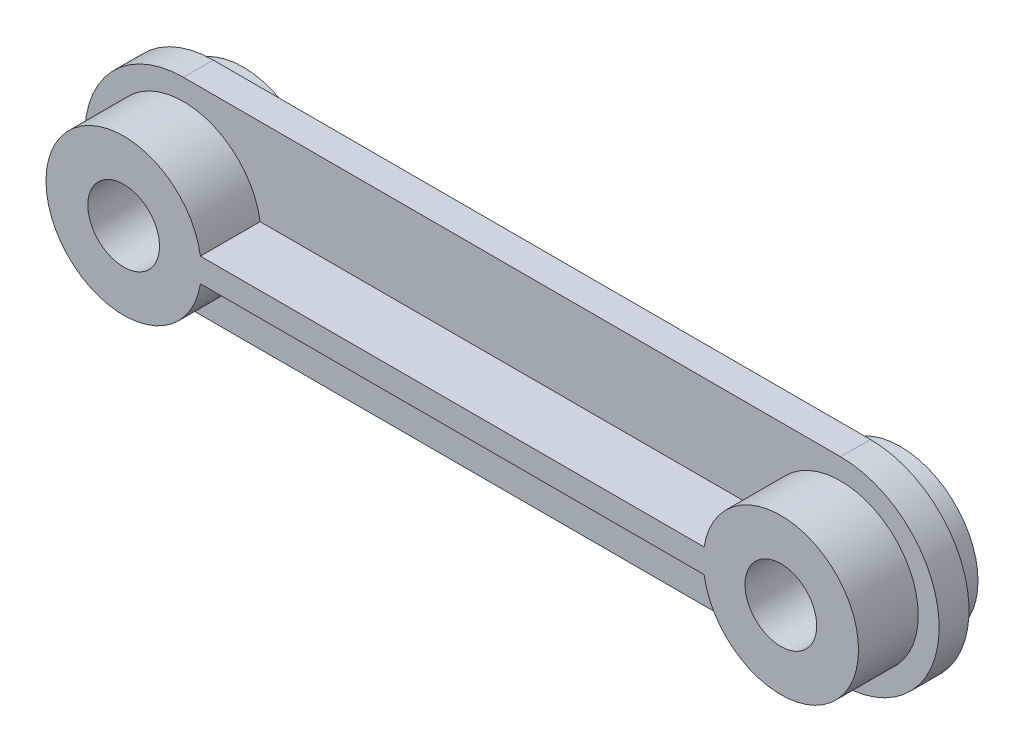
ISO-10303-21;
HEADER;
FILE_DESCRIPTION(('STEP AP214'),'2;1');
FILE_NAME('part.step','',(''),(''),'','','');
FILE_SCHEMA(('AUTOMOTIVE_DESIGN { 1 0 10303 214 1 1 1 1 }'));
ENDSEC;
DATA;
#1=APPLICATION_CONTEXT('core data for automotive mechanical design processes');
#2=APPLICATION_PROTOCOL_DEFINITION('international standard','automotive_design',2000,#1);
#3=PRODUCT_CONTEXT('',#1,'mechanical');
#4=PRODUCT('Part','Part','',(#3));
#5=PRODUCT_RELATED_PRODUCT_CATEGORY('part','',(#4));
#6=PRODUCT_DEFINITION_FORMATION('','',#4);
#7=PRODUCT_DEFINITION_CONTEXT('part definition',#1,'design');
#8=PRODUCT_DEFINITION('design','',#6,#7);
#9=PRODUCT_DEFINITION_SHAPE('','',#8);
#10=(LENGTH_UNIT() NAMED_UNIT(*) SI_UNIT(.MILLI.,.METRE.));
#11=(NAMED_UNIT(*) PLANE_ANGLE_UNIT() SI_UNIT($,.RADIAN.));
#12=(NAMED_UNIT(*) SI_UNIT($,.STERADIAN.) SOLID_ANGLE_UNIT());
#13=UNCERTAINTY_MEASURE_WITH_UNIT(LENGTH_MEASURE(1.E-05),#10,'distance_accuracy_value','');
#14=(GEOMETRIC_REPRESENTATION_CONTEXT(3) GLOBAL_UNCERTAINTY_ASSIGNED_CONTEXT((#13)) GLOBAL_UNIT_ASSIGNED_CONTEXT((#10,
#11,#12)) REPRESENTATION_CONTEXT('',''));
#15=CARTESIAN_POINT('',(0.,0.,0.));
#16=DIRECTION('',(0.,0.,1.));
#17=DIRECTION('',(1.,0.,0.));
#18=AXIS2_PLACEMENT_3D('',#15,#16,#17);
#19=CARTESIAN_POINT('',(-110.,0.,0.));
#20=DIRECTION('',(0.,0.,1.));
#21=DIRECTION('',(1.,0.,0.));
#22=AXIS2_PLACEMENT_3D('',#19,#20,#21);
#23=PLANE('',#22);
#24=CARTESIAN_POINT('',(110.,0.,0.));
#25=DIRECTION('',(0.,0.,1.));
#26=DIRECTION('',(1.,0.,0.));
#27=AXIS2_PLACEMENT_3D('',#24,#25,#26);
#28=CIRCLE('',#27,26.);
#29=CARTESIAN_POINT('',(136.,0.,0.));
#30=VERTEX_POINT('',#29);
#31=EDGE_CURVE('E47',#30,#30,#28,.F.);
#32=ORIENTED_EDGE('',*,*,#31,.F.);
#33=EDGE_LOOP('',(#32));
#34=FACE_BOUND('',#33,.T.);
#35=CARTESIAN_POINT('',(-110.,0.,0.));
#36=DIRECTION('',(0.,0.,1.));
#37=DIRECTION('',(1.,0.,0.));
#38=AXIS2_PLACEMENT_3D('',#35,#36,#37);
#39=CIRCLE('',#38,33.);
#40=CARTESIAN_POINT('',(-110.,33.,0.));
#41=VERTEX_POINT('',#40);
#42=CARTESIAN_POINT('',(-110.,-33.,0.));
#43=VERTEX_POINT('',#42);
#44=EDGE_CURVE('E116',#41,#43,#39,.T.);
#45=ORIENTED_EDGE('',*,*,#44,.F.);
#46=DIRECTION('',(-1.,0.,0.));
#47=VECTOR('',#46,1.);
#48=CARTESIAN_POINT('',(-110.,33.,0.));
#49=LINE('',#48,#47);
#50=CARTESIAN_POINT('',(110.,33.,0.));
#51=VERTEX_POINT('',#50);
#52=EDGE_CURVE('E154',#51,#41,#49,.T.);
#53=ORIENTED_EDGE('',*,*,#52,.F.);
#54=CARTESIAN_POINT('',(110.,0.,0.));
#55=DIRECTION('',(0.,0.,1.));
#56=DIRECTION('',(1.,0.,0.));
#57=AXIS2_PLACEMENT_3D('',#54,#55,#56);
#58=CIRCLE('',#57,33.);
#59=CARTESIAN_POINT('',(110.,-33.,0.));
#60=VERTEX_POINT('',#59);
#61=EDGE_CURVE('E152',#60,#51,#58,.T.);
#62=ORIENTED_EDGE('',*,*,#61,.F.);
#63=DIRECTION('',(1.,0.,0.));
#64=VECTOR('',#63,1.);
#65=CARTESIAN_POINT('',(-110.,-33.,0.));
#66=LINE('',#65,#64);
#67=EDGE_CURVE('E150',#43,#60,#66,.T.);
#68=ORIENTED_EDGE('',*,*,#67,.F.);
#69=EDGE_LOOP('',(#45,#53,#62,#68));
#70=FACE_BOUND('',#69,.T.);
#71=CARTESIAN_POINT('',(-110.,0.,0.));
#72=DIRECTION('',(0.,0.,1.));
#73=DIRECTION('',(1.,0.,0.));
#74=AXIS2_PLACEMENT_3D('',#71,#72,#73);
#75=CIRCLE('',#74,26.);
#76=CARTESIAN_POINT('',(-84.,0.,0.));
#77=VERTEX_POINT('',#76);
#78=EDGE_CURVE('E11',#77,#77,#75,.F.);
#79=ORIENTED_EDGE('',*,*,#78,.F.);
#80=EDGE_LOOP('',(#79));
#81=FACE_BOUND('',#80,.T.);
#82=ADVANCED_FACE('F39',(#34,#70,#81),#23,.F.);
#83=CARTESIAN_POINT('',(-110.,0.,10.));
#84=DIRECTION('',(0.,0.,1.));
#85=DIRECTION('',(1.,0.,0.));
#86=AXIS2_PLACEMENT_3D('',#83,#84,#85);
#87=PLANE('',#86);
#88=CARTESIAN_POINT('',(-110.,0.,10.));
#89=DIRECTION('',(0.,0.,1.));
#90=DIRECTION('',(1.,0.,0.));
#91=AXIS2_PLACEMENT_3D('',#88,#89,#90);
#92=CIRCLE('',#91,33.);
#93=CARTESIAN_POINT('',(-110.,33.,10.));
#94=VERTEX_POINT('',#93);
#95=CARTESIAN_POINT('',(-110.,-33.,10.));
#96=VERTEX_POINT('',#95);
#97=EDGE_CURVE('E156',#94,#96,#92,.T.);
#98=ORIENTED_EDGE('',*,*,#97,.T.);
#99=DIRECTION('',(1.,0.,0.));
#100=VECTOR('',#99,1.);
#101=CARTESIAN_POINT('',(-110.,-33.,10.));
#102=LINE('',#101,#100);
#103=CARTESIAN_POINT('',(110.,-33.,10.));
#104=VERTEX_POINT('',#103);
#105=EDGE_CURVE('E158',#96,#104,#102,.T.);
#106=ORIENTED_EDGE('',*,*,#105,.T.);
#107=CARTESIAN_POINT('',(110.,0.,10.));
#108=DIRECTION('',(0.,0.,1.));
#109=DIRECTION('',(1.,0.,0.));
#110=AXIS2_PLACEMENT_3D('',#107,#108,#109);
#111=CIRCLE('',#110,33.);
#112=CARTESIAN_POINT('',(110.,33.,10.));
#113=VERTEX_POINT('',#112);
#114=EDGE_CURVE('E160',#104,#113,#111,.T.);
#115=ORIENTED_EDGE('',*,*,#114,.T.);
#116=DIRECTION('',(-1.,0.,0.));
#117=VECTOR('',#116,1.);
#118=CARTESIAN_POINT('',(-110.,33.,10.));
#119=LINE('',#118,#117);
#120=EDGE_CURVE('E62',#113,#94,#119,.T.);
#121=ORIENTED_EDGE('',*,*,#120,.T.);
#122=EDGE_LOOP('',(#98,#106,#115,#121));
#123=FACE_BOUND('',#122,.T.);
#124=DIRECTION('',(1.,0.,0.));
#125=VECTOR('',#124,1.);
#126=CARTESIAN_POINT('',(-84.3095348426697,-4.,10.));
#127=LINE('',#126,#125);
#128=CARTESIAN_POINT('',(-84.3095348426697,-4.,10.));
#129=VERTEX_POINT('',#128);
#130=CARTESIAN_POINT('',(84.3095348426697,-4.,10.));
#131=VERTEX_POINT('',#130);
#132=EDGE_CURVE('E110',#129,#131,#127,.T.);
#133=ORIENTED_EDGE('',*,*,#132,.F.);
#134=CARTESIAN_POINT('',(-110.,0.,10.));
#135=DIRECTION('',(0.,0.,1.));
#136=DIRECTION('',(1.,0.,0.));
#137=AXIS2_PLACEMENT_3D('',#134,#135,#136);
#138=CIRCLE('',#137,26.);
#139=CARTESIAN_POINT('',(-84.3095348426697,4.,10.));
#140=VERTEX_POINT('',#139);
#141=EDGE_CURVE('E121',#140,#129,#138,.T.);
#142=ORIENTED_EDGE('',*,*,#141,.F.);
#143=DIRECTION('',(-1.,0.,0.));
#144=VECTOR('',#143,1.);
#145=CARTESIAN_POINT('',(-84.3095348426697,4.,10.));
#146=LINE('',#145,#144);
#147=CARTESIAN_POINT('',(84.3095348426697,4.,10.));
#148=VERTEX_POINT('',#147);
#149=EDGE_CURVE('E133',#148,#140,#146,.T.);
#150=ORIENTED_EDGE('',*,*,#149,.F.);
#151=CARTESIAN_POINT('',(110.,0.,10.));
#152=DIRECTION('',(0.,0.,1.));
#153=DIRECTION('',(1.,0.,0.));
#154=AXIS2_PLACEMENT_3D('',#151,#152,#153);
#155=CIRCLE('',#154,26.);
#156=EDGE_CURVE('E131',#131,#148,#155,.T.);
#157=ORIENTED_EDGE('',*,*,#156,.F.);
#158=EDGE_LOOP('',(#133,#142,#150,#157));
#159=FACE_BOUND('',#158,.T.);
#160=ADVANCED_FACE('F130',(#123,#159),#87,.T.);
#161=CARTESIAN_POINT('',(-110.,0.,10.));
#162=DIRECTION('',(0.,0.,-1.));
#163=DIRECTION('',(-1.,0.,0.));
#164=AXIS2_PLACEMENT_3D('',#161,#162,#163);
#165=CYLINDRICAL_SURFACE('',#164,33.);
#166=ORIENTED_EDGE('',*,*,#44,.T.);
#167=DIRECTION('',(0.,0.,-1.));
#168=VECTOR('',#167,1.);
#169=CARTESIAN_POINT('',(-110.,-33.,10.));
#170=LINE('',#169,#168);
#171=EDGE_CURVE('E172',#96,#43,#170,.T.);
#172=ORIENTED_EDGE('',*,*,#171,.F.);
#173=ORIENTED_EDGE('',*,*,#97,.F.);
#174=DIRECTION('',(0.,0.,-1.));
#175=VECTOR('',#174,1.);
#176=CARTESIAN_POINT('',(-110.,33.,10.));
#177=LINE('',#176,#175);
#178=EDGE_CURVE('E163',#94,#41,#177,.T.);
#179=ORIENTED_EDGE('',*,*,#178,.T.);
#180=EDGE_LOOP('',(#166,#172,#173,#179));
#181=FACE_BOUND('',#180,.T.);
#182=ADVANCED_FACE('F41',(#181),#165,.T.);
#183=CARTESIAN_POINT('',(-110.,-33.,10.));
#184=DIRECTION('',(0.,1.,0.));
#185=DIRECTION('',(-1.,0.,0.));
#186=AXIS2_PLACEMENT_3D('',#183,#184,#185);
#187=PLANE('',#186);
#188=ORIENTED_EDGE('',*,*,#67,.T.);
#189=DIRECTION('',(0.,0.,-1.));
#190=VECTOR('',#189,1.);
#191=CARTESIAN_POINT('',(110.,-33.,10.));
#192=LINE('',#191,#190);
#193=EDGE_CURVE('E169',#104,#60,#192,.T.);
#194=ORIENTED_EDGE('',*,*,#193,.F.);
#195=ORIENTED_EDGE('',*,*,#105,.F.);
#196=ORIENTED_EDGE('',*,*,#171,.T.);
#197=EDGE_LOOP('',(#188,#194,#195,#196));
#198=FACE_BOUND('',#197,.T.);
#199=ADVANCED_FACE('F231',(#198),#187,.F.);
#200=CARTESIAN_POINT('',(110.,0.,10.));
#201=DIRECTION('',(0.,0.,-1.));
#202=DIRECTION('',(-1.,0.,0.));
#203=AXIS2_PLACEMENT_3D('',#200,#201,#202);
#204=CYLINDRICAL_SURFACE('',#203,33.);
#205=ORIENTED_EDGE('',*,*,#61,.T.);
#206=DIRECTION('',(0.,0.,-1.));
#207=VECTOR('',#206,1.);
#208=CARTESIAN_POINT('',(110.,33.,10.));
#209=LINE('',#208,#207);
#210=EDGE_CURVE('E166',#113,#51,#209,.T.);
#211=ORIENTED_EDGE('',*,*,#210,.F.);
#212=ORIENTED_EDGE('',*,*,#114,.F.);
#213=ORIENTED_EDGE('',*,*,#193,.T.);
#214=EDGE_LOOP('',(#205,#211,#212,#213));
#215=FACE_BOUND('',#214,.T.);
#216=ADVANCED_FACE('F228',(#215),#204,.T.);
#217=CARTESIAN_POINT('',(-110.,33.,10.));
#218=DIRECTION('',(0.,-1.,0.));
#219=DIRECTION('',(1.,0.,0.));
#220=AXIS2_PLACEMENT_3D('',#217,#218,#219);
#221=PLANE('',#220);
#222=ORIENTED_EDGE('',*,*,#52,.T.);
#223=ORIENTED_EDGE('',*,*,#178,.F.);
#224=ORIENTED_EDGE('',*,*,#120,.F.);
#225=ORIENTED_EDGE('',*,*,#210,.T.);
#226=EDGE_LOOP('',(#222,#223,#224,#225));
#227=FACE_BOUND('',#226,.T.);
#228=ADVANCED_FACE('F222',(#227),#221,.F.);
#229=CARTESIAN_POINT('',(-110.,0.,30.));
#230=DIRECTION('',(0.,0.,-1.));
#231=DIRECTION('',(-1.,0.,0.));
#232=AXIS2_PLACEMENT_3D('',#229,#230,#231);
#233=CYLINDRICAL_SURFACE('',#232,26.);
#234=ORIENTED_EDGE('',*,*,#141,.T.);
#235=DIRECTION('',(0.,0.,-1.));
#236=VECTOR('',#235,1.);
#237=CARTESIAN_POINT('',(-84.3095348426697,-4.,30.));
#238=LINE('',#237,#236);
#239=CARTESIAN_POINT('',(-84.3095348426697,-4.,30.));
#240=VERTEX_POINT('',#239);
#241=EDGE_CURVE('E105',#240,#129,#238,.T.);
#242=ORIENTED_EDGE('',*,*,#241,.F.);
#243=CARTESIAN_POINT('',(-110.,0.,30.));
#244=DIRECTION('',(0.,0.,1.));
#245=DIRECTION('',(1.,0.,0.));
#246=AXIS2_PLACEMENT_3D('',#243,#244,#245);
#247=CIRCLE('',#246,26.);
#248=CARTESIAN_POINT('',(-84.3095348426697,4.,30.));
#249=VERTEX_POINT('',#248);
#250=EDGE_CURVE('E138',#249,#240,#247,.T.);
#251=ORIENTED_EDGE('',*,*,#250,.F.);
#252=DIRECTION('',(0.,0.,-1.));
#253=VECTOR('',#252,1.);
#254=CARTESIAN_POINT('',(-84.3095348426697,4.,30.));
#255=LINE('',#254,#253);
#256=EDGE_CURVE('E124',#249,#140,#255,.T.);
#257=ORIENTED_EDGE('',*,*,#256,.T.);
#258=EDGE_LOOP('',(#234,#242,#251,#257));
#259=FACE_BOUND('',#258,.T.);
#260=ADVANCED_FACE('F122',(#259),#233,.T.);
#261=CARTESIAN_POINT('',(-84.3095348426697,-4.,30.));
#262=DIRECTION('',(0.,1.,0.));
#263=DIRECTION('',(0.,0.,1.));
#264=AXIS2_PLACEMENT_3D('',#261,#262,#263);
#265=PLANE('',#264);
#266=ORIENTED_EDGE('',*,*,#132,.T.);
#267=DIRECTION('',(0.,0.,-1.));
#268=VECTOR('',#267,1.);
#269=CARTESIAN_POINT('',(84.3095348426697,-4.,30.));
#270=LINE('',#269,#268);
#271=CARTESIAN_POINT('',(84.3095348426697,-4.,30.));
#272=VERTEX_POINT('',#271);
#273=EDGE_CURVE('E117',#272,#131,#270,.T.);
#274=ORIENTED_EDGE('',*,*,#273,.F.);
#275=DIRECTION('',(1.,0.,0.));
#276=VECTOR('',#275,1.);
#277=CARTESIAN_POINT('',(-84.3095348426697,-4.,30.));
#278=LINE('',#277,#276);
#279=EDGE_CURVE('E112',#240,#272,#278,.T.);
#280=ORIENTED_EDGE('',*,*,#279,.F.);
#281=ORIENTED_EDGE('',*,*,#241,.T.);
#282=EDGE_LOOP('',(#266,#274,#280,#281));
#283=FACE_BOUND('',#282,.T.);
#284=ADVANCED_FACE('F107',(#283),#265,.F.);
#285=CARTESIAN_POINT('',(110.,0.,30.));
#286=DIRECTION('',(0.,0.,-1.));
#287=DIRECTION('',(-1.,0.,0.));
#288=AXIS2_PLACEMENT_3D('',#285,#286,#287);
#289=CYLINDRICAL_SURFACE('',#288,26.);
#290=ORIENTED_EDGE('',*,*,#156,.T.);
#291=DIRECTION('',(0.,0.,-1.));
#292=VECTOR('',#291,1.);
#293=CARTESIAN_POINT('',(84.3095348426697,4.,30.));
#294=LINE('',#293,#292);
#295=CARTESIAN_POINT('',(84.3095348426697,4.,30.));
#296=VERTEX_POINT('',#295);
#297=EDGE_CURVE('E54',#296,#148,#294,.T.);
#298=ORIENTED_EDGE('',*,*,#297,.F.);
#299=CARTESIAN_POINT('',(110.,0.,30.));
#300=DIRECTION('',(0.,0.,1.));
#301=DIRECTION('',(1.,0.,0.));
#302=AXIS2_PLACEMENT_3D('',#299,#300,#301);
#303=CIRCLE('',#302,26.);
#304=EDGE_CURVE('E141',#272,#296,#303,.T.);
#305=ORIENTED_EDGE('',*,*,#304,.F.);
#306=ORIENTED_EDGE('',*,*,#273,.T.);
#307=EDGE_LOOP('',(#290,#298,#305,#306));
#308=FACE_BOUND('',#307,.T.);
#309=ADVANCED_FACE('F215',(#308),#289,.T.);
#310=CARTESIAN_POINT('',(-84.3095348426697,4.,30.));
#311=DIRECTION('',(0.,-1.,0.));
#312=DIRECTION('',(0.,0.,-1.));
#313=AXIS2_PLACEMENT_3D('',#310,#311,#312);
#314=PLANE('',#313);
#315=ORIENTED_EDGE('',*,*,#149,.T.);
#316=ORIENTED_EDGE('',*,*,#256,.F.);
#317=DIRECTION('',(-1.,0.,0.));
#318=VECTOR('',#317,1.);
#319=CARTESIAN_POINT('',(-84.3095348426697,4.,30.));
#320=LINE('',#319,#318);
#321=EDGE_CURVE('E143',#296,#249,#320,.T.);
#322=ORIENTED_EDGE('',*,*,#321,.F.);
#323=ORIENTED_EDGE('',*,*,#297,.T.);
#324=EDGE_LOOP('',(#315,#316,#322,#323));
#325=FACE_BOUND('',#324,.T.);
#326=ADVANCED_FACE('F211',(#325),#314,.F.);
#327=CARTESIAN_POINT('',(-110.,0.,30.));
#328=DIRECTION('',(0.,0.,1.));
#329=DIRECTION('',(1.,0.,0.));
#330=AXIS2_PLACEMENT_3D('',#327,#328,#329);
#331=PLANE('',#330);
#332=CARTESIAN_POINT('',(-110.,0.,30.));
#333=DIRECTION('',(0.,0.,-1.));
#334=DIRECTION('',(-1.,0.,0.));
#335=AXIS2_PLACEMENT_3D('',#332,#333,#334);
#336=CIRCLE('',#335,12.);
#337=CARTESIAN_POINT('',(-122.,0.,30.));
#338=VERTEX_POINT('',#337);
#339=EDGE_CURVE('E318',#338,#338,#336,.T.);
#340=ORIENTED_EDGE('',*,*,#339,.T.);
#341=EDGE_LOOP('',(#340));
#342=FACE_BOUND('',#341,.T.);
#343=CARTESIAN_POINT('',(110.,0.,30.));
#344=DIRECTION('',(0.,0.,-1.));
#345=DIRECTION('',(-1.,0.,0.));
#346=AXIS2_PLACEMENT_3D('',#343,#344,#345);
#347=CIRCLE('',#346,12.);
#348=CARTESIAN_POINT('',(98.,0.,30.));
#349=VERTEX_POINT('',#348);
#350=EDGE_CURVE('E328',#349,#349,#347,.T.);
#351=ORIENTED_EDGE('',*,*,#350,.T.);
#352=EDGE_LOOP('',(#351));
#353=FACE_BOUND('',#352,.T.);
#354=ORIENTED_EDGE('',*,*,#250,.T.);
#355=ORIENTED_EDGE('',*,*,#279,.T.);
#356=ORIENTED_EDGE('',*,*,#304,.T.);
#357=ORIENTED_EDGE('',*,*,#321,.T.);
#358=EDGE_LOOP('',(#354,#355,#356,#357));
#359=FACE_BOUND('',#358,.T.);
#360=ADVANCED_FACE('F208',(#342,#353,#359),#331,.T.);
#361=CARTESIAN_POINT('',(110.,0.,-10.));
#362=DIRECTION('',(0.,0.,1.));
#363=DIRECTION('',(1.,0.,0.));
#364=AXIS2_PLACEMENT_3D('',#361,#362,#363);
#365=CYLINDRICAL_SURFACE('',#364,26.);
#366=CARTESIAN_POINT('',(110.,0.,-10.));
#367=DIRECTION('',(0.,0.,-1.));
#368=DIRECTION('',(-1.,0.,0.));
#369=AXIS2_PLACEMENT_3D('',#366,#367,#368);
#370=CIRCLE('',#369,26.);
#371=CARTESIAN_POINT('',(84.,0.,-10.));
#372=VERTEX_POINT('',#371);
#373=EDGE_CURVE('E127',#372,#372,#370,.T.);
#374=ORIENTED_EDGE('',*,*,#373,.F.);
#375=EDGE_LOOP('',(#374));
#376=FACE_BOUND('',#375,.T.);
#377=ORIENTED_EDGE('',*,*,#31,.T.);
#378=EDGE_LOOP('',(#377));
#379=FACE_BOUND('',#378,.T.);
#380=ADVANCED_FACE('F177',(#376,#379),#365,.T.);
#381=CARTESIAN_POINT('',(110.,0.,-10.));
#382=DIRECTION('',(0.,0.,-1.));
#383=DIRECTION('',(-1.,0.,0.));
#384=AXIS2_PLACEMENT_3D('',#381,#382,#383);
#385=PLANE('',#384);
#386=CARTESIAN_POINT('',(110.,0.,-10.));
#387=DIRECTION('',(0.,0.,-1.));
#388=DIRECTION('',(-1.,0.,0.));
#389=AXIS2_PLACEMENT_3D('',#386,#387,#388);
#390=CIRCLE('',#389,12.);
#391=CARTESIAN_POINT('',(98.,0.,-10.));
#392=VERTEX_POINT('',#391);
#393=EDGE_CURVE('E323',#392,#392,#390,.T.);
#394=ORIENTED_EDGE('',*,*,#393,.F.);
#395=EDGE_LOOP('',(#394));
#396=FACE_BOUND('',#395,.T.);
#397=ORIENTED_EDGE('',*,*,#373,.T.);
#398=EDGE_LOOP('',(#397));
#399=FACE_BOUND('',#398,.T.);
#400=ADVANCED_FACE('F190',(#396,#399),#385,.T.);
#401=CARTESIAN_POINT('',(-110.,0.,-10.));
#402=DIRECTION('',(0.,0.,1.));
#403=DIRECTION('',(1.,0.,0.));
#404=AXIS2_PLACEMENT_3D('',#401,#402,#403);
#405=CYLINDRICAL_SURFACE('',#404,26.);
#406=CARTESIAN_POINT('',(-110.,0.,-10.));
#407=DIRECTION('',(0.,0.,-1.));
#408=DIRECTION('',(-1.,0.,0.));
#409=AXIS2_PLACEMENT_3D('',#406,#407,#408);
#410=CIRCLE('',#409,26.);
#411=CARTESIAN_POINT('',(-136.,0.,-10.));
#412=VERTEX_POINT('',#411);
#413=EDGE_CURVE('E331',#412,#412,#410,.T.);
#414=ORIENTED_EDGE('',*,*,#413,.F.);
#415=EDGE_LOOP('',(#414));
#416=FACE_BOUND('',#415,.T.);
#417=ORIENTED_EDGE('',*,*,#78,.T.);
#418=EDGE_LOOP('',(#417));
#419=FACE_BOUND('',#418,.T.);
#420=ADVANCED_FACE('F187',(#416,#419),#405,.T.);
#421=CARTESIAN_POINT('',(-110.,0.,-10.));
#422=DIRECTION('',(0.,0.,-1.));
#423=DIRECTION('',(-1.,0.,0.));
#424=AXIS2_PLACEMENT_3D('',#421,#422,#423);
#425=PLANE('',#424);
#426=CARTESIAN_POINT('',(-110.,0.,-10.));
#427=DIRECTION('',(0.,0.,-1.));
#428=DIRECTION('',(-1.,0.,0.));
#429=AXIS2_PLACEMENT_3D('',#426,#427,#428);
#430=CIRCLE('',#429,12.);
#431=CARTESIAN_POINT('',(-122.,0.,-10.));
#432=VERTEX_POINT('',#431);
#433=EDGE_CURVE('E321',#432,#432,#430,.T.);
#434=ORIENTED_EDGE('',*,*,#433,.F.);
#435=EDGE_LOOP('',(#434));
#436=FACE_BOUND('',#435,.T.);
#437=ORIENTED_EDGE('',*,*,#413,.T.);
#438=EDGE_LOOP('',(#437));
#439=FACE_BOUND('',#438,.T.);
#440=ADVANCED_FACE('F189',(#436,#439),#425,.T.);
#441=CARTESIAN_POINT('',(110.,0.,30.));
#442=DIRECTION('',(0.,0.,-1.));
#443=DIRECTION('',(-1.,0.,0.));
#444=AXIS2_PLACEMENT_3D('',#441,#442,#443);
#445=CYLINDRICAL_SURFACE('',#444,12.);
#446=ORIENTED_EDGE('',*,*,#350,.F.);
#447=EDGE_LOOP('',(#446));
#448=FACE_BOUND('',#447,.T.);
#449=ORIENTED_EDGE('',*,*,#393,.T.);
#450=EDGE_LOOP('',(#449));
#451=FACE_BOUND('',#450,.T.);
#452=ADVANCED_FACE('F198',(#448,#451),#445,.F.);
#453=CARTESIAN_POINT('',(-110.,0.,30.));
#454=DIRECTION('',(0.,0.,-1.));
#455=DIRECTION('',(-1.,0.,0.));
#456=AXIS2_PLACEMENT_3D('',#453,#454,#455);
#457=CYLINDRICAL_SURFACE('',#456,12.);
#458=ORIENTED_EDGE('',*,*,#339,.F.);
#459=EDGE_LOOP('',(#458));
#460=FACE_BOUND('',#459,.T.);
#461=ORIENTED_EDGE('',*,*,#433,.T.);
#462=EDGE_LOOP('',(#461));
#463=FACE_BOUND('',#462,.T.);
#464=ADVANCED_FACE('F306',(#460,#463),#457,.F.);
#465=CLOSED_SHELL('',(#82,#160,#182,#199,#216,#228,#260,#284,#309,#326,#360,#380,#400,#420,#440,
#452,#464));
#466=MANIFOLD_SOLID_BREP('B2',#465);
#467=ADVANCED_BREP_SHAPE_REPRESENTATION('',(#18,#466),#14);
#468=SHAPE_DEFINITION_REPRESENTATION(#9,#467);
ENDSEC;
END-ISO-10303-21;
